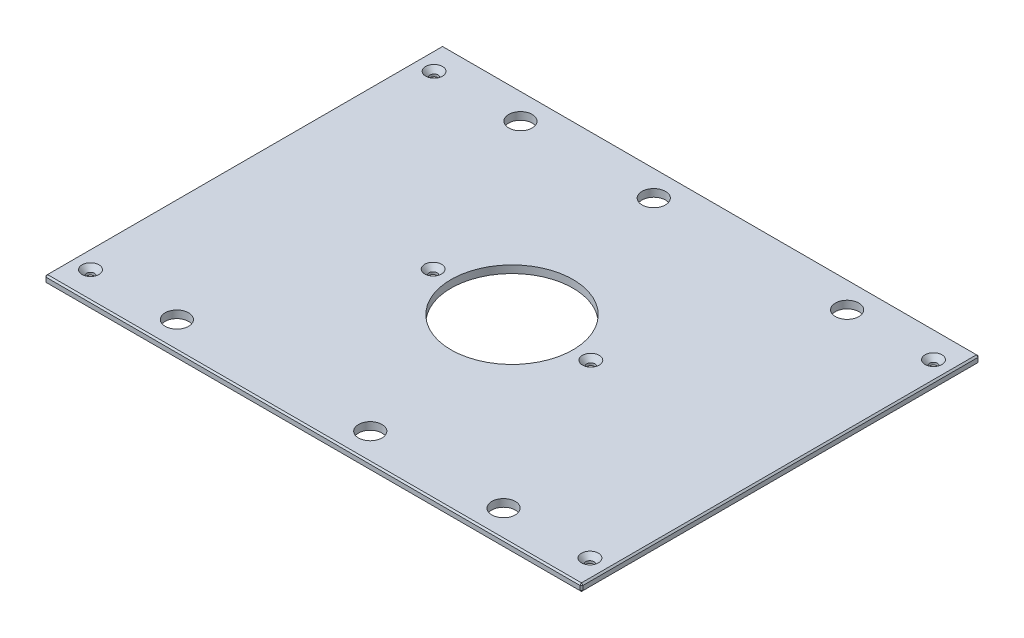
ISO-10303-21;
HEADER;
FILE_DESCRIPTION(('STEP AP214'),'2;1');
FILE_NAME('part.step','',(''),(''),'','','');
FILE_SCHEMA(('AUTOMOTIVE_DESIGN { 1 0 10303 214 1 1 1 1 }'));
ENDSEC;
DATA;
#1=APPLICATION_CONTEXT('core data for automotive mechanical design processes');
#2=APPLICATION_PROTOCOL_DEFINITION('international standard','automotive_design',2000,#1);
#3=PRODUCT_CONTEXT('',#1,'mechanical');
#4=PRODUCT('Part','Part','',(#3));
#5=PRODUCT_RELATED_PRODUCT_CATEGORY('part','',(#4));
#6=PRODUCT_DEFINITION_FORMATION('','',#4);
#7=PRODUCT_DEFINITION_CONTEXT('part definition',#1,'design');
#8=PRODUCT_DEFINITION('design','',#6,#7);
#9=PRODUCT_DEFINITION_SHAPE('','',#8);
#10=(LENGTH_UNIT() NAMED_UNIT(*) SI_UNIT(.MILLI.,.METRE.));
#11=(NAMED_UNIT(*) PLANE_ANGLE_UNIT() SI_UNIT($,.RADIAN.));
#12=(NAMED_UNIT(*) SI_UNIT($,.STERADIAN.) SOLID_ANGLE_UNIT());
#13=UNCERTAINTY_MEASURE_WITH_UNIT(LENGTH_MEASURE(1.E-05),#10,'distance_accuracy_value','');
#14=(GEOMETRIC_REPRESENTATION_CONTEXT(3) GLOBAL_UNCERTAINTY_ASSIGNED_CONTEXT((#13)) GLOBAL_UNIT_ASSIGNED_CONTEXT((#10,
#11,#12)) REPRESENTATION_CONTEXT('',''));
#15=CARTESIAN_POINT('',(0.,0.,0.));
#16=DIRECTION('',(0.,0.,1.));
#17=DIRECTION('',(1.,0.,0.));
#18=AXIS2_PLACEMENT_3D('',#15,#16,#17);
#19=CARTESIAN_POINT('',(-227.0125,6.35,-168.275));
#20=DIRECTION('',(1.,0.,0.));
#21=DIRECTION('',(0.,0.,-1.));
#22=AXIS2_PLACEMENT_3D('',#19,#20,#21);
#23=PLANE('',#22);
#24=DIRECTION('',(0.,0.,-1.));
#25=VECTOR('',#24,1.);
#26=CARTESIAN_POINT('',(-227.0125,5.08000000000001,-168.275));
#27=LINE('',#26,#25);
#28=CARTESIAN_POINT('',(-227.0125,5.08000000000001,167.005));
#29=VERTEX_POINT('',#28);
#30=CARTESIAN_POINT('',(-227.0125,5.08000000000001,-167.005));
#31=VERTEX_POINT('',#30);
#32=EDGE_CURVE('E140',#29,#31,#27,.T.);
#33=ORIENTED_EDGE('',*,*,#32,.T.);
#34=DIRECTION('',(0.,-1.,0.));
#35=VECTOR('',#34,1.);
#36=CARTESIAN_POINT('',(-227.0125,6.35,-167.005));
#37=LINE('',#36,#35);
#38=CARTESIAN_POINT('',(-227.0125,1.26999999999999,-167.005));
#39=VERTEX_POINT('',#38);
#40=EDGE_CURVE('E135',#31,#39,#37,.T.);
#41=ORIENTED_EDGE('',*,*,#40,.T.);
#42=DIRECTION('',(0.,0.,1.));
#43=VECTOR('',#42,1.);
#44=CARTESIAN_POINT('',(-227.0125,1.26999999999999,-168.275));
#45=LINE('',#44,#43);
#46=CARTESIAN_POINT('',(-227.0125,1.26999999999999,167.005));
#47=VERTEX_POINT('',#46);
#48=EDGE_CURVE('E130',#39,#47,#45,.T.);
#49=ORIENTED_EDGE('',*,*,#48,.T.);
#50=DIRECTION('',(0.,1.,0.));
#51=VECTOR('',#50,1.);
#52=CARTESIAN_POINT('',(-227.0125,6.35,167.005));
#53=LINE('',#52,#51);
#54=EDGE_CURVE('E132',#47,#29,#53,.T.);
#55=ORIENTED_EDGE('',*,*,#54,.T.);
#56=EDGE_LOOP('',(#33,#41,#49,#55));
#57=FACE_BOUND('',#56,.T.);
#58=ADVANCED_FACE('F38',(#57),#23,.F.);
#59=CARTESIAN_POINT('',(-227.0125,6.35,168.275));
#60=DIRECTION('',(0.,0.,-1.));
#61=DIRECTION('',(-1.,0.,0.));
#62=AXIS2_PLACEMENT_3D('',#59,#60,#61);
#63=PLANE('',#62);
#64=DIRECTION('',(1.,0.,0.));
#65=VECTOR('',#64,1.);
#66=CARTESIAN_POINT('',(-227.0125,1.26999999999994,168.275));
#67=LINE('',#66,#65);
#68=CARTESIAN_POINT('',(-225.7425,1.26999999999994,168.275));
#69=VERTEX_POINT('',#68);
#70=CARTESIAN_POINT('',(225.7425,1.26999999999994,168.275));
#71=VERTEX_POINT('',#70);
#72=EDGE_CURVE('E62',#69,#71,#67,.T.);
#73=ORIENTED_EDGE('',*,*,#72,.T.);
#74=DIRECTION('',(0.,1.,0.));
#75=VECTOR('',#74,1.);
#76=CARTESIAN_POINT('',(225.7425,6.35,168.275));
#77=LINE('',#76,#75);
#78=CARTESIAN_POINT('',(225.7425,5.08000000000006,168.275));
#79=VERTEX_POINT('',#78);
#80=EDGE_CURVE('E11',#71,#79,#77,.T.);
#81=ORIENTED_EDGE('',*,*,#80,.T.);
#82=DIRECTION('',(-1.,0.,0.));
#83=VECTOR('',#82,1.);
#84=CARTESIAN_POINT('',(-227.0125,5.08000000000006,168.275));
#85=LINE('',#84,#83);
#86=CARTESIAN_POINT('',(-225.7425,5.08000000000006,168.275));
#87=VERTEX_POINT('',#86);
#88=EDGE_CURVE('E48',#79,#87,#85,.T.);
#89=ORIENTED_EDGE('',*,*,#88,.T.);
#90=DIRECTION('',(0.,-1.,0.));
#91=VECTOR('',#90,1.);
#92=CARTESIAN_POINT('',(-225.7425,6.35,168.275));
#93=LINE('',#92,#91);
#94=EDGE_CURVE('E348',#87,#69,#93,.T.);
#95=ORIENTED_EDGE('',*,*,#94,.T.);
#96=EDGE_LOOP('',(#73,#81,#89,#95));
#97=FACE_BOUND('',#96,.T.);
#98=ADVANCED_FACE('F427',(#97),#63,.F.);
#99=CARTESIAN_POINT('',(227.0125,6.35,-168.275));
#100=DIRECTION('',(-1.,0.,0.));
#101=DIRECTION('',(0.,0.,1.));
#102=AXIS2_PLACEMENT_3D('',#99,#100,#101);
#103=PLANE('',#102);
#104=DIRECTION('',(0.,0.,-1.));
#105=VECTOR('',#104,1.);
#106=CARTESIAN_POINT('',(227.0125,1.26999999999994,-168.275));
#107=LINE('',#106,#105);
#108=CARTESIAN_POINT('',(227.0125,1.26999999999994,167.005));
#109=VERTEX_POINT('',#108);
#110=CARTESIAN_POINT('',(227.0125,1.26999999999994,-167.005));
#111=VERTEX_POINT('',#110);
#112=EDGE_CURVE('E341',#109,#111,#107,.T.);
#113=ORIENTED_EDGE('',*,*,#112,.T.);
#114=DIRECTION('',(0.,1.,0.));
#115=VECTOR('',#114,1.);
#116=CARTESIAN_POINT('',(227.0125,6.35,-167.005));
#117=LINE('',#116,#115);
#118=CARTESIAN_POINT('',(227.0125,5.08000000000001,-167.005));
#119=VERTEX_POINT('',#118);
#120=EDGE_CURVE('E344',#111,#119,#117,.T.);
#121=ORIENTED_EDGE('',*,*,#120,.T.);
#122=DIRECTION('',(0.,0.,1.));
#123=VECTOR('',#122,1.);
#124=CARTESIAN_POINT('',(227.0125,5.08000000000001,168.275));
#125=LINE('',#124,#123);
#126=CARTESIAN_POINT('',(227.0125,5.08000000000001,167.005));
#127=VERTEX_POINT('',#126);
#128=EDGE_CURVE('E338',#119,#127,#125,.T.);
#129=ORIENTED_EDGE('',*,*,#128,.T.);
#130=DIRECTION('',(0.,-1.,0.));
#131=VECTOR('',#130,1.);
#132=CARTESIAN_POINT('',(227.0125,6.35,167.005));
#133=LINE('',#132,#131);
#134=EDGE_CURVE('E335',#127,#109,#133,.T.);
#135=ORIENTED_EDGE('',*,*,#134,.T.);
#136=EDGE_LOOP('',(#113,#121,#129,#135));
#137=FACE_BOUND('',#136,.T.);
#138=ADVANCED_FACE('F414',(#137),#103,.F.);
#139=CARTESIAN_POINT('',(-227.0125,6.35,-168.275));
#140=DIRECTION('',(0.,0.,1.));
#141=DIRECTION('',(1.,0.,0.));
#142=AXIS2_PLACEMENT_3D('',#139,#140,#141);
#143=PLANE('',#142);
#144=DIRECTION('',(-1.,0.,0.));
#145=VECTOR('',#144,1.);
#146=CARTESIAN_POINT('',(-227.0125,1.26999999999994,-168.275));
#147=LINE('',#146,#145);
#148=CARTESIAN_POINT('',(225.7425,1.26999999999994,-168.275));
#149=VERTEX_POINT('',#148);
#150=CARTESIAN_POINT('',(-225.7425,1.26999999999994,-168.275));
#151=VERTEX_POINT('',#150);
#152=EDGE_CURVE('E300',#149,#151,#147,.T.);
#153=ORIENTED_EDGE('',*,*,#152,.T.);
#154=DIRECTION('',(0.,1.,0.));
#155=VECTOR('',#154,1.);
#156=CARTESIAN_POINT('',(-225.7425,6.35,-168.275));
#157=LINE('',#156,#155);
#158=CARTESIAN_POINT('',(-225.7425,5.08000000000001,-168.275));
#159=VERTEX_POINT('',#158);
#160=EDGE_CURVE('E306',#151,#159,#157,.T.);
#161=ORIENTED_EDGE('',*,*,#160,.T.);
#162=DIRECTION('',(1.,0.,0.));
#163=VECTOR('',#162,1.);
#164=CARTESIAN_POINT('',(227.0125,5.08000000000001,-168.275));
#165=LINE('',#164,#163);
#166=CARTESIAN_POINT('',(225.7425,5.08000000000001,-168.275));
#167=VERTEX_POINT('',#166);
#168=EDGE_CURVE('E303',#159,#167,#165,.T.);
#169=ORIENTED_EDGE('',*,*,#168,.T.);
#170=DIRECTION('',(0.,-1.,0.));
#171=VECTOR('',#170,1.);
#172=CARTESIAN_POINT('',(225.7425,6.35,-168.275));
#173=LINE('',#172,#171);
#174=EDGE_CURVE('E297',#167,#149,#173,.T.);
#175=ORIENTED_EDGE('',*,*,#174,.T.);
#176=EDGE_LOOP('',(#153,#161,#169,#175));
#177=FACE_BOUND('',#176,.T.);
#178=ADVANCED_FACE('F388',(#177),#143,.F.);
#179=CARTESIAN_POINT('',(0.,6.35,0.));
#180=DIRECTION('',(0.,1.,0.));
#181=DIRECTION('',(0.,0.,1.));
#182=AXIS2_PLACEMENT_3D('',#179,#180,#181);
#183=PLANE('',#182);
#184=CARTESIAN_POINT('',(211.1375,6.35,-145.25498));
#185=DIRECTION('',(0.,1.,0.));
#186=DIRECTION('',(0.,0.,1.));
#187=AXIS2_PLACEMENT_3D('',#184,#185,#186);
#188=CIRCLE('',#187,7.13739999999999);
#189=CARTESIAN_POINT('',(211.1375,6.35,-138.11758));
#190=VERTEX_POINT('',#189);
#191=EDGE_CURVE('E927',#190,#190,#188,.T.);
#192=ORIENTED_EDGE('',*,*,#191,.F.);
#193=EDGE_LOOP('',(#192));
#194=FACE_BOUND('',#193,.T.);
#195=CARTESIAN_POINT('',(211.1375,6.35,145.25498));
#196=DIRECTION('',(0.,1.,0.));
#197=DIRECTION('',(0.,0.,1.));
#198=AXIS2_PLACEMENT_3D('',#195,#196,#197);
#199=CIRCLE('',#198,7.13739999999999);
#200=CARTESIAN_POINT('',(211.1375,6.35,152.39238));
#201=VERTEX_POINT('',#200);
#202=EDGE_CURVE('E931',#201,#201,#199,.T.);
#203=ORIENTED_EDGE('',*,*,#202,.F.);
#204=EDGE_LOOP('',(#203));
#205=FACE_BOUND('',#204,.T.);
#206=CARTESIAN_POINT('',(-211.1375,6.35,145.25498));
#207=DIRECTION('',(0.,1.,0.));
#208=DIRECTION('',(0.,0.,1.));
#209=AXIS2_PLACEMENT_3D('',#206,#207,#208);
#210=CIRCLE('',#209,7.13739999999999);
#211=CARTESIAN_POINT('',(-211.1375,6.35,152.39238));
#212=VERTEX_POINT('',#211);
#213=EDGE_CURVE('E935',#212,#212,#210,.T.);
#214=ORIENTED_EDGE('',*,*,#213,.F.);
#215=EDGE_LOOP('',(#214));
#216=FACE_BOUND('',#215,.T.);
#217=CARTESIAN_POINT('',(-66.675,6.35,0.));
#218=DIRECTION('',(0.,1.,0.));
#219=DIRECTION('',(0.,0.,1.));
#220=AXIS2_PLACEMENT_3D('',#217,#218,#219);
#221=CIRCLE('',#220,7.1374);
#222=CARTESIAN_POINT('',(-66.675,6.35,7.1374));
#223=VERTEX_POINT('',#222);
#224=EDGE_CURVE('E939',#223,#223,#221,.T.);
#225=ORIENTED_EDGE('',*,*,#224,.F.);
#226=EDGE_LOOP('',(#225));
#227=FACE_BOUND('',#226,.T.);
#228=CARTESIAN_POINT('',(66.675,6.35,0.));
#229=DIRECTION('',(0.,1.,0.));
#230=DIRECTION('',(0.,0.,1.));
#231=AXIS2_PLACEMENT_3D('',#228,#229,#230);
#232=CIRCLE('',#231,7.1374);
#233=CARTESIAN_POINT('',(66.675,6.35,7.1374));
#234=VERTEX_POINT('',#233);
#235=EDGE_CURVE('E943',#234,#234,#232,.T.);
#236=ORIENTED_EDGE('',*,*,#235,.F.);
#237=EDGE_LOOP('',(#236));
#238=FACE_BOUND('',#237,.T.);
#239=CARTESIAN_POINT('',(-211.1375,6.35,-145.25498));
#240=DIRECTION('',(0.,1.,0.));
#241=DIRECTION('',(0.,0.,1.));
#242=AXIS2_PLACEMENT_3D('',#239,#240,#241);
#243=CIRCLE('',#242,7.13739999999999);
#244=CARTESIAN_POINT('',(-211.1375,6.35,-138.11758));
#245=VERTEX_POINT('',#244);
#246=EDGE_CURVE('E946',#245,#245,#243,.T.);
#247=ORIENTED_EDGE('',*,*,#246,.F.);
#248=EDGE_LOOP('',(#247));
#249=FACE_BOUND('',#248,.T.);
#250=DIRECTION('',(0.,0.,-1.));
#251=VECTOR('',#250,1.);
#252=CARTESIAN_POINT('',(225.7425,6.35,-168.275));
#253=LINE('',#252,#251);
#254=CARTESIAN_POINT('',(225.7425,6.35,167.005));
#255=VERTEX_POINT('',#254);
#256=CARTESIAN_POINT('',(225.7425,6.35,-167.005));
#257=VERTEX_POINT('',#256);
#258=EDGE_CURVE('E316',#255,#257,#253,.T.);
#259=ORIENTED_EDGE('',*,*,#258,.T.);
#260=DIRECTION('',(-1.,0.,0.));
#261=VECTOR('',#260,1.);
#262=CARTESIAN_POINT('',(-227.0125,6.35,-167.005));
#263=LINE('',#262,#261);
#264=CARTESIAN_POINT('',(-225.7425,6.35,-167.005));
#265=VERTEX_POINT('',#264);
#266=EDGE_CURVE('E319',#257,#265,#263,.T.);
#267=ORIENTED_EDGE('',*,*,#266,.T.);
#268=DIRECTION('',(0.,0.,1.));
#269=VECTOR('',#268,1.);
#270=CARTESIAN_POINT('',(-225.7425,6.35,168.275));
#271=LINE('',#270,#269);
#272=CARTESIAN_POINT('',(-225.7425,6.35,167.005));
#273=VERTEX_POINT('',#272);
#274=EDGE_CURVE('E313',#265,#273,#271,.T.);
#275=ORIENTED_EDGE('',*,*,#274,.T.);
#276=DIRECTION('',(1.,0.,0.));
#277=VECTOR('',#276,1.);
#278=CARTESIAN_POINT('',(227.0125,6.35,167.005));
#279=LINE('',#278,#277);
#280=EDGE_CURVE('E310',#273,#255,#279,.T.);
#281=ORIENTED_EDGE('',*,*,#280,.T.);
#282=EDGE_LOOP('',(#259,#267,#275,#281));
#283=FACE_BOUND('',#282,.T.);
#284=CARTESIAN_POINT('',(138.1125,6.35,-145.25498));
#285=DIRECTION('',(0.,1.,0.));
#286=DIRECTION('',(0.,0.,1.));
#287=AXIS2_PLACEMENT_3D('',#284,#285,#286);
#288=CIRCLE('',#287,9.921875);
#289=CARTESIAN_POINT('',(138.1125,6.35,-135.333105));
#290=VERTEX_POINT('',#289);
#291=EDGE_CURVE('E229',#290,#290,#288,.T.);
#292=ORIENTED_EDGE('',*,*,#291,.F.);
#293=EDGE_LOOP('',(#292));
#294=FACE_BOUND('',#293,.T.);
#295=CARTESIAN_POINT('',(-138.1125,6.35,-145.25498));
#296=DIRECTION('',(0.,1.,0.));
#297=DIRECTION('',(0.,0.,1.));
#298=AXIS2_PLACEMENT_3D('',#295,#296,#297);
#299=CIRCLE('',#298,9.921875);
#300=CARTESIAN_POINT('',(-138.1125,6.35,-135.333105));
#301=VERTEX_POINT('',#300);
#302=EDGE_CURVE('E243',#301,#301,#299,.T.);
#303=ORIENTED_EDGE('',*,*,#302,.F.);
#304=EDGE_LOOP('',(#303));
#305=FACE_BOUND('',#304,.T.);
#306=CARTESIAN_POINT('',(138.1125,6.35,145.25498));
#307=DIRECTION('',(0.,1.,0.));
#308=DIRECTION('',(0.,0.,1.));
#309=AXIS2_PLACEMENT_3D('',#306,#307,#308);
#310=CIRCLE('',#309,9.921875);
#311=CARTESIAN_POINT('',(138.1125,6.35,155.176855));
#312=VERTEX_POINT('',#311);
#313=EDGE_CURVE('E255',#312,#312,#310,.T.);
#314=ORIENTED_EDGE('',*,*,#313,.F.);
#315=EDGE_LOOP('',(#314));
#316=FACE_BOUND('',#315,.T.);
#317=CARTESIAN_POINT('',(-138.1125,6.35,145.25498));
#318=DIRECTION('',(0.,1.,0.));
#319=DIRECTION('',(0.,0.,1.));
#320=AXIS2_PLACEMENT_3D('',#317,#318,#319);
#321=CIRCLE('',#320,9.921875);
#322=CARTESIAN_POINT('',(-138.1125,6.35,155.176855));
#323=VERTEX_POINT('',#322);
#324=EDGE_CURVE('E262',#323,#323,#321,.T.);
#325=ORIENTED_EDGE('',*,*,#324,.F.);
#326=EDGE_LOOP('',(#325));
#327=FACE_BOUND('',#326,.T.);
#328=CARTESIAN_POINT('',(-25.4,6.35,-145.25498));
#329=DIRECTION('',(0.,1.,0.));
#330=DIRECTION('',(0.,0.,1.));
#331=AXIS2_PLACEMENT_3D('',#328,#329,#330);
#332=CIRCLE('',#331,9.921875);
#333=CARTESIAN_POINT('',(-25.4,6.35,-135.333105));
#334=VERTEX_POINT('',#333);
#335=EDGE_CURVE('E270',#334,#334,#332,.T.);
#336=ORIENTED_EDGE('',*,*,#335,.F.);
#337=EDGE_LOOP('',(#336));
#338=FACE_BOUND('',#337,.T.);
#339=CARTESIAN_POINT('',(25.4,6.35,145.25498));
#340=DIRECTION('',(0.,1.,0.));
#341=DIRECTION('',(0.,0.,1.));
#342=AXIS2_PLACEMENT_3D('',#339,#340,#341);
#343=CIRCLE('',#342,9.921875);
#344=CARTESIAN_POINT('',(25.4,6.35,155.176855));
#345=VERTEX_POINT('',#344);
#346=EDGE_CURVE('E278',#345,#345,#343,.T.);
#347=ORIENTED_EDGE('',*,*,#346,.F.);
#348=EDGE_LOOP('',(#347));
#349=FACE_BOUND('',#348,.T.);
#350=CARTESIAN_POINT('',(0.,6.35,0.));
#351=DIRECTION('',(0.,1.,0.));
#352=DIRECTION('',(0.,0.,1.));
#353=AXIS2_PLACEMENT_3D('',#350,#351,#352);
#354=CIRCLE('',#353,51.562);
#355=CARTESIAN_POINT('',(0.,6.35,51.562));
#356=VERTEX_POINT('',#355);
#357=EDGE_CURVE('E286',#356,#356,#354,.T.);
#358=ORIENTED_EDGE('',*,*,#357,.F.);
#359=EDGE_LOOP('',(#358));
#360=FACE_BOUND('',#359,.T.);
#361=ADVANCED_FACE('F436',(#194,#205,#216,#227,#238,#249,#283,#294,#305,#316,#327,#338,#349,
#360),#183,.T.);
#362=CARTESIAN_POINT('',(0.,0.,0.));
#363=DIRECTION('',(0.,1.,0.));
#364=DIRECTION('',(0.,0.,1.));
#365=AXIS2_PLACEMENT_3D('',#362,#363,#364);
#366=PLANE('',#365);
#367=CARTESIAN_POINT('',(211.1375,0.,-145.25498));
#368=DIRECTION('',(0.,1.,0.));
#369=DIRECTION('',(0.,0.,1.));
#370=AXIS2_PLACEMENT_3D('',#367,#368,#369);
#371=CIRCLE('',#370,3.3782);
#372=CARTESIAN_POINT('',(211.1375,0.,-141.87678));
#373=VERTEX_POINT('',#372);
#374=EDGE_CURVE('E992',#373,#373,#371,.T.);
#375=ORIENTED_EDGE('',*,*,#374,.T.);
#376=EDGE_LOOP('',(#375));
#377=FACE_BOUND('',#376,.T.);
#378=CARTESIAN_POINT('',(211.1375,0.,145.25498));
#379=DIRECTION('',(0.,1.,0.));
#380=DIRECTION('',(0.,0.,1.));
#381=AXIS2_PLACEMENT_3D('',#378,#379,#380);
#382=CIRCLE('',#381,3.3782);
#383=CARTESIAN_POINT('',(211.1375,0.,148.63318));
#384=VERTEX_POINT('',#383);
#385=EDGE_CURVE('E982',#384,#384,#382,.T.);
#386=ORIENTED_EDGE('',*,*,#385,.T.);
#387=EDGE_LOOP('',(#386));
#388=FACE_BOUND('',#387,.T.);
#389=CARTESIAN_POINT('',(-211.1375,0.,145.25498));
#390=DIRECTION('',(0.,1.,0.));
#391=DIRECTION('',(0.,0.,1.));
#392=AXIS2_PLACEMENT_3D('',#389,#390,#391);
#393=CIRCLE('',#392,3.3782);
#394=CARTESIAN_POINT('',(-211.1375,0.,148.63318));
#395=VERTEX_POINT('',#394);
#396=EDGE_CURVE('E972',#395,#395,#393,.T.);
#397=ORIENTED_EDGE('',*,*,#396,.T.);
#398=EDGE_LOOP('',(#397));
#399=FACE_BOUND('',#398,.T.);
#400=CARTESIAN_POINT('',(-66.675,0.,0.));
#401=DIRECTION('',(0.,1.,0.));
#402=DIRECTION('',(0.,0.,1.));
#403=AXIS2_PLACEMENT_3D('',#400,#401,#402);
#404=CIRCLE('',#403,3.3782);
#405=CARTESIAN_POINT('',(-66.675,0.,3.3782));
#406=VERTEX_POINT('',#405);
#407=EDGE_CURVE('E964',#406,#406,#404,.T.);
#408=ORIENTED_EDGE('',*,*,#407,.T.);
#409=EDGE_LOOP('',(#408));
#410=FACE_BOUND('',#409,.T.);
#411=CARTESIAN_POINT('',(66.675,0.,0.));
#412=DIRECTION('',(0.,1.,0.));
#413=DIRECTION('',(0.,0.,1.));
#414=AXIS2_PLACEMENT_3D('',#411,#412,#413);
#415=CIRCLE('',#414,3.3782);
#416=CARTESIAN_POINT('',(66.675,0.,3.3782));
#417=VERTEX_POINT('',#416);
#418=EDGE_CURVE('E950',#417,#417,#415,.T.);
#419=ORIENTED_EDGE('',*,*,#418,.T.);
#420=EDGE_LOOP('',(#419));
#421=FACE_BOUND('',#420,.T.);
#422=CARTESIAN_POINT('',(-211.1375,0.,-145.25498));
#423=DIRECTION('',(0.,1.,0.));
#424=DIRECTION('',(0.,0.,1.));
#425=AXIS2_PLACEMENT_3D('',#422,#423,#424);
#426=CIRCLE('',#425,3.3782);
#427=CARTESIAN_POINT('',(-211.1375,0.,-141.87678));
#428=VERTEX_POINT('',#427);
#429=EDGE_CURVE('E246',#428,#428,#426,.T.);
#430=ORIENTED_EDGE('',*,*,#429,.T.);
#431=EDGE_LOOP('',(#430));
#432=FACE_BOUND('',#431,.T.);
#433=DIRECTION('',(0.,0.,-1.));
#434=VECTOR('',#433,1.);
#435=CARTESIAN_POINT('',(-225.7425,0.,0.));
#436=LINE('',#435,#434);
#437=CARTESIAN_POINT('',(-225.7425,0.,167.005));
#438=VERTEX_POINT('',#437);
#439=CARTESIAN_POINT('',(-225.7425,0.,-167.005));
#440=VERTEX_POINT('',#439);
#441=EDGE_CURVE('E165',#438,#440,#436,.T.);
#442=ORIENTED_EDGE('',*,*,#441,.T.);
#443=DIRECTION('',(1.,0.,0.));
#444=VECTOR('',#443,1.);
#445=CARTESIAN_POINT('',(0.,0.,-167.005));
#446=LINE('',#445,#444);
#447=CARTESIAN_POINT('',(225.7425,0.,-167.005));
#448=VERTEX_POINT('',#447);
#449=EDGE_CURVE('E331',#440,#448,#446,.T.);
#450=ORIENTED_EDGE('',*,*,#449,.T.);
#451=DIRECTION('',(0.,0.,1.));
#452=VECTOR('',#451,1.);
#453=CARTESIAN_POINT('',(225.7425,0.,0.));
#454=LINE('',#453,#452);
#455=CARTESIAN_POINT('',(225.7425,0.,167.005));
#456=VERTEX_POINT('',#455);
#457=EDGE_CURVE('E328',#448,#456,#454,.T.);
#458=ORIENTED_EDGE('',*,*,#457,.T.);
#459=DIRECTION('',(-1.,0.,0.));
#460=VECTOR('',#459,1.);
#461=CARTESIAN_POINT('',(0.,0.,167.005));
#462=LINE('',#461,#460);
#463=EDGE_CURVE('E323',#456,#438,#462,.T.);
#464=ORIENTED_EDGE('',*,*,#463,.T.);
#465=EDGE_LOOP('',(#442,#450,#458,#464));
#466=FACE_BOUND('',#465,.T.);
#467=CARTESIAN_POINT('',(138.1125,0.,-145.25498));
#468=DIRECTION('',(0.,1.,0.));
#469=DIRECTION('',(0.,0.,1.));
#470=AXIS2_PLACEMENT_3D('',#467,#468,#469);
#471=CIRCLE('',#470,9.921875);
#472=CARTESIAN_POINT('',(138.1125,0.,-135.333105));
#473=VERTEX_POINT('',#472);
#474=EDGE_CURVE('E236',#473,#473,#471,.T.);
#475=ORIENTED_EDGE('',*,*,#474,.T.);
#476=EDGE_LOOP('',(#475));
#477=FACE_BOUND('',#476,.T.);
#478=CARTESIAN_POINT('',(-138.1125,0.,-145.25498));
#479=DIRECTION('',(0.,1.,0.));
#480=DIRECTION('',(0.,0.,1.));
#481=AXIS2_PLACEMENT_3D('',#478,#479,#480);
#482=CIRCLE('',#481,9.921875);
#483=CARTESIAN_POINT('',(-138.1125,0.,-135.333105));
#484=VERTEX_POINT('',#483);
#485=EDGE_CURVE('E251',#484,#484,#482,.T.);
#486=ORIENTED_EDGE('',*,*,#485,.T.);
#487=EDGE_LOOP('',(#486));
#488=FACE_BOUND('',#487,.T.);
#489=CARTESIAN_POINT('',(138.1125,0.,145.25498));
#490=DIRECTION('',(0.,1.,0.));
#491=DIRECTION('',(0.,0.,1.));
#492=AXIS2_PLACEMENT_3D('',#489,#490,#491);
#493=CIRCLE('',#492,9.921875);
#494=CARTESIAN_POINT('',(138.1125,0.,155.176855));
#495=VERTEX_POINT('',#494);
#496=EDGE_CURVE('E258',#495,#495,#493,.T.);
#497=ORIENTED_EDGE('',*,*,#496,.T.);
#498=EDGE_LOOP('',(#497));
#499=FACE_BOUND('',#498,.T.);
#500=CARTESIAN_POINT('',(-138.1125,0.,145.25498));
#501=DIRECTION('',(0.,1.,0.));
#502=DIRECTION('',(0.,0.,1.));
#503=AXIS2_PLACEMENT_3D('',#500,#501,#502);
#504=CIRCLE('',#503,9.921875);
#505=CARTESIAN_POINT('',(-138.1125,0.,155.176855));
#506=VERTEX_POINT('',#505);
#507=EDGE_CURVE('E266',#506,#506,#504,.T.);
#508=ORIENTED_EDGE('',*,*,#507,.T.);
#509=EDGE_LOOP('',(#508));
#510=FACE_BOUND('',#509,.T.);
#511=CARTESIAN_POINT('',(-25.4,0.,-145.25498));
#512=DIRECTION('',(0.,1.,0.));
#513=DIRECTION('',(0.,0.,1.));
#514=AXIS2_PLACEMENT_3D('',#511,#512,#513);
#515=CIRCLE('',#514,9.921875);
#516=CARTESIAN_POINT('',(-25.4,0.,-135.333105));
#517=VERTEX_POINT('',#516);
#518=EDGE_CURVE('E274',#517,#517,#515,.T.);
#519=ORIENTED_EDGE('',*,*,#518,.T.);
#520=EDGE_LOOP('',(#519));
#521=FACE_BOUND('',#520,.T.);
#522=CARTESIAN_POINT('',(25.4,0.,145.25498));
#523=DIRECTION('',(0.,1.,0.));
#524=DIRECTION('',(0.,0.,1.));
#525=AXIS2_PLACEMENT_3D('',#522,#523,#524);
#526=CIRCLE('',#525,9.921875);
#527=CARTESIAN_POINT('',(25.4,0.,155.176855));
#528=VERTEX_POINT('',#527);
#529=EDGE_CURVE('E282',#528,#528,#526,.T.);
#530=ORIENTED_EDGE('',*,*,#529,.T.);
#531=EDGE_LOOP('',(#530));
#532=FACE_BOUND('',#531,.T.);
#533=CARTESIAN_POINT('',(0.,0.,0.));
#534=DIRECTION('',(0.,1.,0.));
#535=DIRECTION('',(0.,0.,1.));
#536=AXIS2_PLACEMENT_3D('',#533,#534,#535);
#537=CIRCLE('',#536,51.562);
#538=CARTESIAN_POINT('',(0.,0.,51.562));
#539=VERTEX_POINT('',#538);
#540=EDGE_CURVE('E153',#539,#539,#537,.T.);
#541=ORIENTED_EDGE('',*,*,#540,.T.);
#542=EDGE_LOOP('',(#541));
#543=FACE_BOUND('',#542,.T.);
#544=ADVANCED_FACE('F401',(#377,#388,#399,#410,#421,#432,#466,#477,#488,#499,#510,#521,#532,
#543),#366,.F.);
#545=CARTESIAN_POINT('',(0.,0.,0.));
#546=DIRECTION('',(0.,1.,0.));
#547=DIRECTION('',(0.,0.,1.));
#548=AXIS2_PLACEMENT_3D('',#545,#546,#547);
#549=CYLINDRICAL_SURFACE('',#548,51.562);
#550=ORIENTED_EDGE('',*,*,#540,.F.);
#551=EDGE_LOOP('',(#550));
#552=FACE_BOUND('',#551,.T.);
#553=ORIENTED_EDGE('',*,*,#357,.T.);
#554=EDGE_LOOP('',(#553));
#555=FACE_BOUND('',#554,.T.);
#556=ADVANCED_FACE('F682',(#552,#555),#549,.F.);
#557=CARTESIAN_POINT('',(25.4,6.35,145.25498));
#558=DIRECTION('',(0.,1.,0.));
#559=DIRECTION('',(0.,0.,1.));
#560=AXIS2_PLACEMENT_3D('',#557,#558,#559);
#561=CYLINDRICAL_SURFACE('',#560,9.921875);
#562=ORIENTED_EDGE('',*,*,#529,.F.);
#563=EDGE_LOOP('',(#562));
#564=FACE_BOUND('',#563,.T.);
#565=ORIENTED_EDGE('',*,*,#346,.T.);
#566=EDGE_LOOP('',(#565));
#567=FACE_BOUND('',#566,.T.);
#568=ADVANCED_FACE('F856',(#564,#567),#561,.F.);
#569=CARTESIAN_POINT('',(-25.4,6.35,-145.25498));
#570=DIRECTION('',(0.,1.,0.));
#571=DIRECTION('',(0.,0.,1.));
#572=AXIS2_PLACEMENT_3D('',#569,#570,#571);
#573=CYLINDRICAL_SURFACE('',#572,9.921875);
#574=ORIENTED_EDGE('',*,*,#518,.F.);
#575=EDGE_LOOP('',(#574));
#576=FACE_BOUND('',#575,.T.);
#577=ORIENTED_EDGE('',*,*,#335,.T.);
#578=EDGE_LOOP('',(#577));
#579=FACE_BOUND('',#578,.T.);
#580=ADVANCED_FACE('F846',(#576,#579),#573,.F.);
#581=CARTESIAN_POINT('',(-138.1125,6.35,145.25498));
#582=DIRECTION('',(0.,1.,0.));
#583=DIRECTION('',(0.,0.,1.));
#584=AXIS2_PLACEMENT_3D('',#581,#582,#583);
#585=CYLINDRICAL_SURFACE('',#584,9.921875);
#586=ORIENTED_EDGE('',*,*,#507,.F.);
#587=EDGE_LOOP('',(#586));
#588=FACE_BOUND('',#587,.T.);
#589=ORIENTED_EDGE('',*,*,#324,.T.);
#590=EDGE_LOOP('',(#589));
#591=FACE_BOUND('',#590,.T.);
#592=ADVANCED_FACE('F836',(#588,#591),#585,.F.);
#593=CARTESIAN_POINT('',(138.1125,6.35,145.25498));
#594=DIRECTION('',(0.,1.,0.));
#595=DIRECTION('',(0.,0.,1.));
#596=AXIS2_PLACEMENT_3D('',#593,#594,#595);
#597=CYLINDRICAL_SURFACE('',#596,9.921875);
#598=ORIENTED_EDGE('',*,*,#496,.F.);
#599=EDGE_LOOP('',(#598));
#600=FACE_BOUND('',#599,.T.);
#601=ORIENTED_EDGE('',*,*,#313,.T.);
#602=EDGE_LOOP('',(#601));
#603=FACE_BOUND('',#602,.T.);
#604=ADVANCED_FACE('F826',(#600,#603),#597,.F.);
#605=CARTESIAN_POINT('',(-138.1125,6.35,-145.25498));
#606=DIRECTION('',(0.,1.,0.));
#607=DIRECTION('',(0.,0.,1.));
#608=AXIS2_PLACEMENT_3D('',#605,#606,#607);
#609=CYLINDRICAL_SURFACE('',#608,9.921875);
#610=ORIENTED_EDGE('',*,*,#485,.F.);
#611=EDGE_LOOP('',(#610));
#612=FACE_BOUND('',#611,.T.);
#613=ORIENTED_EDGE('',*,*,#302,.T.);
#614=EDGE_LOOP('',(#613));
#615=FACE_BOUND('',#614,.T.);
#616=ADVANCED_FACE('F816',(#612,#615),#609,.F.);
#617=CARTESIAN_POINT('',(138.1125,6.35,-145.25498));
#618=DIRECTION('',(0.,1.,0.));
#619=DIRECTION('',(0.,0.,1.));
#620=AXIS2_PLACEMENT_3D('',#617,#618,#619);
#621=CYLINDRICAL_SURFACE('',#620,9.921875);
#622=ORIENTED_EDGE('',*,*,#474,.F.);
#623=EDGE_LOOP('',(#622));
#624=FACE_BOUND('',#623,.T.);
#625=ORIENTED_EDGE('',*,*,#291,.T.);
#626=EDGE_LOOP('',(#625));
#627=FACE_BOUND('',#626,.T.);
#628=ADVANCED_FACE('F445',(#624,#627),#621,.F.);
#629=CARTESIAN_POINT('',(227.0125,6.35,167.005));
#630=DIRECTION('',(-0.707106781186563,0.,-0.707106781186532));
#631=DIRECTION('',(0.,-1.,0.));
#632=AXIS2_PLACEMENT_3D('',#629,#630,#631);
#633=PLANE('',#632);
#634=DIRECTION('',(-0.707106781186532,0.,0.707106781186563));
#635=VECTOR('',#634,1.);
#636=CARTESIAN_POINT('',(227.0125,5.08000000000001,167.005));
#637=LINE('',#636,#635);
#638=EDGE_CURVE('E42',#79,#127,#637,.F.);
#639=ORIENTED_EDGE('',*,*,#638,.F.);
#640=ORIENTED_EDGE('',*,*,#80,.F.);
#641=DIRECTION('',(0.707106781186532,0.,-0.707106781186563));
#642=VECTOR('',#641,1.);
#643=CARTESIAN_POINT('',(226.3775,1.26999999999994,167.64));
#644=LINE('',#643,#642);
#645=EDGE_CURVE('E219',#109,#71,#644,.F.);
#646=ORIENTED_EDGE('',*,*,#645,.F.);
#647=ORIENTED_EDGE('',*,*,#134,.F.);
#648=EDGE_LOOP('',(#639,#640,#646,#647));
#649=FACE_BOUND('',#648,.T.);
#650=ADVANCED_FACE('F40',(#649),#633,.F.);
#651=CARTESIAN_POINT('',(227.0125,5.08000000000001,167.005));
#652=DIRECTION('',(0.577350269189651,0.577350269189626,0.577350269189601));
#653=DIRECTION('',(-0.707106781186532,0.707106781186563,0.));
#654=AXIS2_PLACEMENT_3D('',#651,#652,#653);
#655=PLANE('',#654);
#656=DIRECTION('',(0.,-0.707106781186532,0.707106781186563));
#657=VECTOR('',#656,1.);
#658=CARTESIAN_POINT('',(225.7425,5.71500000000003,167.64));
#659=LINE('',#658,#657);
#660=EDGE_CURVE('E214',#79,#255,#659,.F.);
#661=ORIENTED_EDGE('',*,*,#660,.F.);
#662=ORIENTED_EDGE('',*,*,#638,.T.);
#663=DIRECTION('',(-0.707106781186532,0.707106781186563,0.));
#664=VECTOR('',#663,1.);
#665=CARTESIAN_POINT('',(227.0125,5.08000000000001,167.005));
#666=LINE('',#665,#664);
#667=EDGE_CURVE('E216',#255,#127,#666,.F.);
#668=ORIENTED_EDGE('',*,*,#667,.F.);
#669=EDGE_LOOP('',(#661,#662,#668));
#670=FACE_BOUND('',#669,.T.);
#671=ADVANCED_FACE('F438',(#670),#655,.T.);
#672=CARTESIAN_POINT('',(225.7425,0.,167.005));
#673=DIRECTION('',(0.577350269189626,-0.577350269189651,0.577350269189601));
#674=DIRECTION('',(0.707106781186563,0.707106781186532,0.));
#675=AXIS2_PLACEMENT_3D('',#672,#673,#674);
#676=PLANE('',#675);
#677=DIRECTION('',(-0.707106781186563,-0.707106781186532,0.));
#678=VECTOR('',#677,1.);
#679=CARTESIAN_POINT('',(225.7425,0.,167.005));
#680=LINE('',#679,#678);
#681=EDGE_CURVE('E206',#109,#456,#680,.T.);
#682=ORIENTED_EDGE('',*,*,#681,.F.);
#683=ORIENTED_EDGE('',*,*,#645,.T.);
#684=DIRECTION('',(0.,0.707106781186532,0.707106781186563));
#685=VECTOR('',#684,1.);
#686=CARTESIAN_POINT('',(225.7425,0.,167.005));
#687=LINE('',#686,#685);
#688=EDGE_CURVE('E210',#456,#71,#687,.T.);
#689=ORIENTED_EDGE('',*,*,#688,.F.);
#690=EDGE_LOOP('',(#682,#683,#689));
#691=FACE_BOUND('',#690,.T.);
#692=ADVANCED_FACE('F407',(#691),#676,.T.);
#693=CARTESIAN_POINT('',(225.7425,6.35,0.));
#694=DIRECTION('',(0.707106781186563,0.707106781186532,0.));
#695=DIRECTION('',(0.,0.,1.));
#696=AXIS2_PLACEMENT_3D('',#693,#694,#695);
#697=PLANE('',#696);
#698=ORIENTED_EDGE('',*,*,#667,.T.);
#699=ORIENTED_EDGE('',*,*,#128,.F.);
#700=DIRECTION('',(0.707106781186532,-0.707106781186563,0.));
#701=VECTOR('',#700,1.);
#702=CARTESIAN_POINT('',(226.3775,5.715,-167.005));
#703=LINE('',#702,#701);
#704=EDGE_CURVE('E199',#257,#119,#703,.T.);
#705=ORIENTED_EDGE('',*,*,#704,.F.);
#706=ORIENTED_EDGE('',*,*,#258,.F.);
#707=EDGE_LOOP('',(#698,#699,#705,#706));
#708=FACE_BOUND('',#707,.T.);
#709=ADVANCED_FACE('F424',(#708),#697,.T.);
#710=CARTESIAN_POINT('',(0.,6.35,167.005));
#711=DIRECTION('',(0.,0.707106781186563,0.707106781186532));
#712=DIRECTION('',(-1.,0.,0.));
#713=AXIS2_PLACEMENT_3D('',#710,#711,#712);
#714=PLANE('',#713);
#715=ORIENTED_EDGE('',*,*,#660,.T.);
#716=ORIENTED_EDGE('',*,*,#280,.F.);
#717=DIRECTION('',(0.,0.707106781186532,-0.707106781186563));
#718=VECTOR('',#717,1.);
#719=CARTESIAN_POINT('',(-225.7425,6.35,167.005));
#720=LINE('',#719,#718);
#721=EDGE_CURVE('E195',#87,#273,#720,.T.);
#722=ORIENTED_EDGE('',*,*,#721,.F.);
#723=ORIENTED_EDGE('',*,*,#88,.F.);
#724=EDGE_LOOP('',(#715,#716,#722,#723));
#725=FACE_BOUND('',#724,.T.);
#726=ADVANCED_FACE('F429',(#725),#714,.T.);
#727=CARTESIAN_POINT('',(-225.7425,6.35,168.275));
#728=DIRECTION('',(0.707106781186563,0.,-0.707106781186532));
#729=DIRECTION('',(0.,-1.,0.));
#730=AXIS2_PLACEMENT_3D('',#727,#728,#729);
#731=PLANE('',#730);
#732=DIRECTION('',(0.707106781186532,0.,0.707106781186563));
#733=VECTOR('',#732,1.);
#734=CARTESIAN_POINT('',(-227.0125,1.26999999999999,167.005));
#735=LINE('',#734,#733);
#736=EDGE_CURVE('E147',#69,#47,#735,.F.);
#737=ORIENTED_EDGE('',*,*,#736,.F.);
#738=ORIENTED_EDGE('',*,*,#94,.F.);
#739=DIRECTION('',(-0.707106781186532,0.,-0.707106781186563));
#740=VECTOR('',#739,1.);
#741=CARTESIAN_POINT('',(-226.3775,5.08000000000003,167.64));
#742=LINE('',#741,#740);
#743=EDGE_CURVE('E150',#29,#87,#742,.F.);
#744=ORIENTED_EDGE('',*,*,#743,.F.);
#745=ORIENTED_EDGE('',*,*,#54,.F.);
#746=EDGE_LOOP('',(#737,#738,#744,#745));
#747=FACE_BOUND('',#746,.T.);
#748=ADVANCED_FACE('F145',(#747),#731,.F.);
#749=CARTESIAN_POINT('',(-227.0125,1.26999999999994,168.275));
#750=DIRECTION('',(0.,0.707106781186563,-0.707106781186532));
#751=DIRECTION('',(1.,0.,0.));
#752=AXIS2_PLACEMENT_3D('',#749,#750,#751);
#753=PLANE('',#752);
#754=ORIENTED_EDGE('',*,*,#688,.T.);
#755=ORIENTED_EDGE('',*,*,#72,.F.);
#756=DIRECTION('',(0.,-0.707106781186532,-0.707106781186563));
#757=VECTOR('',#756,1.);
#758=CARTESIAN_POINT('',(-225.7425,0.634999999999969,167.64));
#759=LINE('',#758,#757);
#760=EDGE_CURVE('E161',#438,#69,#759,.F.);
#761=ORIENTED_EDGE('',*,*,#760,.F.);
#762=ORIENTED_EDGE('',*,*,#463,.F.);
#763=EDGE_LOOP('',(#754,#755,#761,#762));
#764=FACE_BOUND('',#763,.T.);
#765=ADVANCED_FACE('F406',(#764),#753,.F.);
#766=CARTESIAN_POINT('',(227.0125,1.26999999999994,-168.275));
#767=DIRECTION('',(-0.707106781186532,0.707106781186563,0.));
#768=DIRECTION('',(0.,0.,-1.));
#769=AXIS2_PLACEMENT_3D('',#766,#767,#768);
#770=PLANE('',#769);
#771=ORIENTED_EDGE('',*,*,#681,.T.);
#772=ORIENTED_EDGE('',*,*,#457,.F.);
#773=DIRECTION('',(0.707106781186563,0.707106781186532,0.));
#774=VECTOR('',#773,1.);
#775=CARTESIAN_POINT('',(225.7425,0.,-167.005));
#776=LINE('',#775,#774);
#777=EDGE_CURVE('E187',#111,#448,#776,.F.);
#778=ORIENTED_EDGE('',*,*,#777,.F.);
#779=ORIENTED_EDGE('',*,*,#112,.F.);
#780=EDGE_LOOP('',(#771,#772,#778,#779));
#781=FACE_BOUND('',#780,.T.);
#782=ADVANCED_FACE('F411',(#781),#770,.F.);
#783=CARTESIAN_POINT('',(225.7425,6.35,-168.275));
#784=DIRECTION('',(-0.707106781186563,0.,0.707106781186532));
#785=DIRECTION('',(0.,-1.,0.));
#786=AXIS2_PLACEMENT_3D('',#783,#784,#785);
#787=PLANE('',#786);
#788=DIRECTION('',(0.707106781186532,0.,0.707106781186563));
#789=VECTOR('',#788,1.);
#790=CARTESIAN_POINT('',(225.7425,5.08000000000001,-168.275));
#791=LINE('',#790,#789);
#792=EDGE_CURVE('E202',#119,#167,#791,.F.);
#793=ORIENTED_EDGE('',*,*,#792,.F.);
#794=ORIENTED_EDGE('',*,*,#120,.F.);
#795=DIRECTION('',(-0.707106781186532,0.,-0.707106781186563));
#796=VECTOR('',#795,1.);
#797=CARTESIAN_POINT('',(226.3775,1.26999999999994,-167.64));
#798=LINE('',#797,#796);
#799=EDGE_CURVE('E183',#149,#111,#798,.F.);
#800=ORIENTED_EDGE('',*,*,#799,.F.);
#801=ORIENTED_EDGE('',*,*,#174,.F.);
#802=EDGE_LOOP('',(#793,#794,#800,#801));
#803=FACE_BOUND('',#802,.T.);
#804=ADVANCED_FACE('F419',(#803),#787,.F.);
#805=CARTESIAN_POINT('',(225.7425,5.08000000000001,-168.275));
#806=DIRECTION('',(0.577350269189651,0.577350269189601,-0.577350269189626));
#807=DIRECTION('',(-0.707106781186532,0.,-0.707106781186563));
#808=AXIS2_PLACEMENT_3D('',#805,#806,#807);
#809=PLANE('',#808);
#810=ORIENTED_EDGE('',*,*,#704,.T.);
#811=ORIENTED_EDGE('',*,*,#792,.T.);
#812=DIRECTION('',(0.,0.707106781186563,0.707106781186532));
#813=VECTOR('',#812,1.);
#814=CARTESIAN_POINT('',(225.7425,5.08000000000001,-168.275));
#815=LINE('',#814,#813);
#816=EDGE_CURVE('E173',#257,#167,#815,.F.);
#817=ORIENTED_EDGE('',*,*,#816,.F.);
#818=EDGE_LOOP('',(#810,#811,#817));
#819=FACE_BOUND('',#818,.T.);
#820=ADVANCED_FACE('F477',(#819),#809,.T.);
#821=CARTESIAN_POINT('',(-225.7425,6.35,167.005));
#822=DIRECTION('',(-0.577350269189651,0.577350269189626,0.577350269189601));
#823=DIRECTION('',(-0.707106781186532,-0.707106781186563,0.));
#824=AXIS2_PLACEMENT_3D('',#821,#822,#823);
#825=PLANE('',#824);
#826=ORIENTED_EDGE('',*,*,#743,.T.);
#827=ORIENTED_EDGE('',*,*,#721,.T.);
#828=DIRECTION('',(-0.707106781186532,-0.707106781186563,0.));
#829=VECTOR('',#828,1.);
#830=CARTESIAN_POINT('',(-225.7425,6.35,167.005));
#831=LINE('',#830,#829);
#832=EDGE_CURVE('E167',#29,#273,#831,.F.);
#833=ORIENTED_EDGE('',*,*,#832,.F.);
#834=EDGE_LOOP('',(#826,#827,#833));
#835=FACE_BOUND('',#834,.T.);
#836=ADVANCED_FACE('F431',(#835),#825,.T.);
#837=CARTESIAN_POINT('',(-227.0125,1.26999999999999,167.005));
#838=DIRECTION('',(-0.577350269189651,-0.577350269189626,0.577350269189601));
#839=DIRECTION('',(0.707106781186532,-0.707106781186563,0.));
#840=AXIS2_PLACEMENT_3D('',#837,#838,#839);
#841=PLANE('',#840);
#842=ORIENTED_EDGE('',*,*,#760,.T.);
#843=ORIENTED_EDGE('',*,*,#736,.T.);
#844=DIRECTION('',(-0.707106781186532,0.707106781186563,0.));
#845=VECTOR('',#844,1.);
#846=CARTESIAN_POINT('',(-227.0125,1.26999999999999,167.005));
#847=LINE('',#846,#845);
#848=EDGE_CURVE('E158',#438,#47,#847,.T.);
#849=ORIENTED_EDGE('',*,*,#848,.F.);
#850=EDGE_LOOP('',(#842,#843,#849));
#851=FACE_BOUND('',#850,.T.);
#852=ADVANCED_FACE('F157',(#851),#841,.T.);
#853=CARTESIAN_POINT('',(225.7425,0.,-167.005));
#854=DIRECTION('',(0.577350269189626,-0.577350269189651,-0.577350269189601));
#855=DIRECTION('',(0.707106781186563,0.707106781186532,0.));
#856=AXIS2_PLACEMENT_3D('',#853,#854,#855);
#857=PLANE('',#856);
#858=ORIENTED_EDGE('',*,*,#799,.T.);
#859=ORIENTED_EDGE('',*,*,#777,.T.);
#860=DIRECTION('',(0.,-0.707106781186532,0.707106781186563));
#861=VECTOR('',#860,1.);
#862=CARTESIAN_POINT('',(225.7425,0.,-167.005));
#863=LINE('',#862,#861);
#864=EDGE_CURVE('E168',#149,#448,#863,.T.);
#865=ORIENTED_EDGE('',*,*,#864,.F.);
#866=EDGE_LOOP('',(#858,#859,#865));
#867=FACE_BOUND('',#866,.T.);
#868=ADVANCED_FACE('F469',(#867),#857,.T.);
#869=CARTESIAN_POINT('',(0.,6.35,-167.005));
#870=DIRECTION('',(0.,0.707106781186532,-0.707106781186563));
#871=DIRECTION('',(1.,0.,0.));
#872=AXIS2_PLACEMENT_3D('',#869,#870,#871);
#873=PLANE('',#872);
#874=ORIENTED_EDGE('',*,*,#816,.T.);
#875=ORIENTED_EDGE('',*,*,#168,.F.);
#876=DIRECTION('',(0.,-0.707106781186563,-0.707106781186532));
#877=VECTOR('',#876,1.);
#878=CARTESIAN_POINT('',(-225.7425,5.08000000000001,-168.275));
#879=LINE('',#878,#877);
#880=EDGE_CURVE('E176',#265,#159,#879,.T.);
#881=ORIENTED_EDGE('',*,*,#880,.F.);
#882=ORIENTED_EDGE('',*,*,#266,.F.);
#883=EDGE_LOOP('',(#874,#875,#881,#882));
#884=FACE_BOUND('',#883,.T.);
#885=ADVANCED_FACE('F383',(#884),#873,.T.);
#886=CARTESIAN_POINT('',(-225.7425,6.35,0.));
#887=DIRECTION('',(-0.707106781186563,0.707106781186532,0.));
#888=DIRECTION('',(0.,0.,-1.));
#889=AXIS2_PLACEMENT_3D('',#886,#887,#888);
#890=PLANE('',#889);
#891=ORIENTED_EDGE('',*,*,#832,.T.);
#892=ORIENTED_EDGE('',*,*,#274,.F.);
#893=DIRECTION('',(0.707106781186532,0.707106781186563,0.));
#894=VECTOR('',#893,1.);
#895=CARTESIAN_POINT('',(-226.3775,5.715,-167.005));
#896=LINE('',#895,#894);
#897=EDGE_CURVE('E369',#31,#265,#896,.T.);
#898=ORIENTED_EDGE('',*,*,#897,.F.);
#899=ORIENTED_EDGE('',*,*,#32,.F.);
#900=EDGE_LOOP('',(#891,#892,#898,#899));
#901=FACE_BOUND('',#900,.T.);
#902=ADVANCED_FACE('F434',(#901),#890,.T.);
#903=CARTESIAN_POINT('',(-227.0125,1.26999999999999,-168.275));
#904=DIRECTION('',(0.707106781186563,0.707106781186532,0.));
#905=DIRECTION('',(0.,0.,1.));
#906=AXIS2_PLACEMENT_3D('',#903,#904,#905);
#907=PLANE('',#906);
#908=ORIENTED_EDGE('',*,*,#848,.T.);
#909=ORIENTED_EDGE('',*,*,#48,.F.);
#910=DIRECTION('',(0.707106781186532,-0.707106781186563,0.));
#911=VECTOR('',#910,1.);
#912=CARTESIAN_POINT('',(-227.0125,1.26999999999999,-167.005));
#913=LINE('',#912,#911);
#914=EDGE_CURVE('E365',#440,#39,#913,.F.);
#915=ORIENTED_EDGE('',*,*,#914,.F.);
#916=ORIENTED_EDGE('',*,*,#441,.F.);
#917=EDGE_LOOP('',(#908,#909,#915,#916));
#918=FACE_BOUND('',#917,.T.);
#919=ADVANCED_FACE('F164',(#918),#907,.F.);
#920=CARTESIAN_POINT('',(-227.0125,1.26999999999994,-168.275));
#921=DIRECTION('',(0.,0.707106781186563,0.707106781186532));
#922=DIRECTION('',(-1.,0.,0.));
#923=AXIS2_PLACEMENT_3D('',#920,#921,#922);
#924=PLANE('',#923);
#925=ORIENTED_EDGE('',*,*,#864,.T.);
#926=ORIENTED_EDGE('',*,*,#449,.F.);
#927=DIRECTION('',(0.,0.707106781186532,-0.707106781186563));
#928=VECTOR('',#927,1.);
#929=CARTESIAN_POINT('',(-225.7425,0.634999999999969,-167.64));
#930=LINE('',#929,#928);
#931=EDGE_CURVE('E361',#151,#440,#930,.F.);
#932=ORIENTED_EDGE('',*,*,#931,.F.);
#933=ORIENTED_EDGE('',*,*,#152,.F.);
#934=EDGE_LOOP('',(#925,#926,#932,#933));
#935=FACE_BOUND('',#934,.T.);
#936=ADVANCED_FACE('F398',(#935),#924,.F.);
#937=CARTESIAN_POINT('',(-225.7425,5.08000000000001,-168.275));
#938=DIRECTION('',(-0.577350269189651,0.577350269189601,-0.577350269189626));
#939=DIRECTION('',(-0.707106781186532,0.,0.707106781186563));
#940=AXIS2_PLACEMENT_3D('',#937,#938,#939);
#941=PLANE('',#940);
#942=ORIENTED_EDGE('',*,*,#897,.T.);
#943=ORIENTED_EDGE('',*,*,#880,.T.);
#944=DIRECTION('',(0.707106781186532,0.,-0.707106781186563));
#945=VECTOR('',#944,1.);
#946=CARTESIAN_POINT('',(-225.7425,5.08000000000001,-168.275));
#947=LINE('',#946,#945);
#948=EDGE_CURVE('E358',#31,#159,#947,.T.);
#949=ORIENTED_EDGE('',*,*,#948,.F.);
#950=EDGE_LOOP('',(#942,#943,#949));
#951=FACE_BOUND('',#950,.T.);
#952=ADVANCED_FACE('F378',(#951),#941,.T.);
#953=CARTESIAN_POINT('',(-227.0125,1.26999999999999,-167.005));
#954=DIRECTION('',(-0.577350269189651,-0.577350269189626,-0.577350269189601));
#955=DIRECTION('',(0.707106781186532,-0.707106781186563,0.));
#956=AXIS2_PLACEMENT_3D('',#953,#954,#955);
#957=PLANE('',#956);
#958=ORIENTED_EDGE('',*,*,#931,.T.);
#959=ORIENTED_EDGE('',*,*,#914,.T.);
#960=DIRECTION('',(-0.707106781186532,0.,0.707106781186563));
#961=VECTOR('',#960,1.);
#962=CARTESIAN_POINT('',(-227.0125,1.26999999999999,-167.005));
#963=LINE('',#962,#961);
#964=EDGE_CURVE('E355',#151,#39,#963,.T.);
#965=ORIENTED_EDGE('',*,*,#964,.F.);
#966=EDGE_LOOP('',(#958,#959,#965));
#967=FACE_BOUND('',#966,.T.);
#968=ADVANCED_FACE('F395',(#967),#957,.T.);
#969=CARTESIAN_POINT('',(-227.0125,6.35,-167.005));
#970=DIRECTION('',(0.707106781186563,0.,0.707106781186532));
#971=DIRECTION('',(0.,-1.,0.));
#972=AXIS2_PLACEMENT_3D('',#969,#970,#971);
#973=PLANE('',#972);
#974=ORIENTED_EDGE('',*,*,#948,.T.);
#975=ORIENTED_EDGE('',*,*,#160,.F.);
#976=ORIENTED_EDGE('',*,*,#964,.T.);
#977=ORIENTED_EDGE('',*,*,#40,.F.);
#978=EDGE_LOOP('',(#974,#975,#976,#977));
#979=FACE_BOUND('',#978,.T.);
#980=ADVANCED_FACE('F393',(#979),#973,.F.);
#981=CARTESIAN_POINT('',(-211.1375,6.35,-145.25498));
#982=DIRECTION('',(0.,1.,0.));
#983=DIRECTION('',(0.,0.,1.));
#984=AXIS2_PLACEMENT_3D('',#981,#982,#983);
#985=CYLINDRICAL_SURFACE('',#984,3.3782);
#986=ORIENTED_EDGE('',*,*,#429,.F.);
#987=EDGE_LOOP('',(#986));
#988=FACE_BOUND('',#987,.T.);
#989=CARTESIAN_POINT('',(-211.1375,2.02553508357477,-145.25498));
#990=DIRECTION('',(0.,1.,0.));
#991=DIRECTION('',(0.,0.,1.));
#992=AXIS2_PLACEMENT_3D('',#989,#990,#991);
#993=CIRCLE('',#992,3.3782);
#994=CARTESIAN_POINT('',(-211.1375,2.02553508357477,-141.87678));
#995=VERTEX_POINT('',#994);
#996=EDGE_CURVE('E949',#995,#995,#993,.T.);
#997=ORIENTED_EDGE('',*,*,#996,.T.);
#998=EDGE_LOOP('',(#997));
#999=FACE_BOUND('',#998,.T.);
#1000=ADVANCED_FACE('F456',(#988,#999),#985,.F.);
#1001=CARTESIAN_POINT('',(-211.1375,6.35,-145.25498));
#1002=DIRECTION('',(0.,1.,0.));
#1003=DIRECTION('',(0.,0.,1.));
#1004=AXIS2_PLACEMENT_3D('',#1001,#1002,#1003);
#1005=CONICAL_SURFACE('',#1004,7.13739999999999,0.715584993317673);
#1006=ORIENTED_EDGE('',*,*,#996,.F.);
#1007=EDGE_LOOP('',(#1006));
#1008=FACE_BOUND('',#1007,.T.);
#1009=ORIENTED_EDGE('',*,*,#246,.T.);
#1010=EDGE_LOOP('',(#1009));
#1011=FACE_BOUND('',#1010,.T.);
#1012=ADVANCED_FACE('F548',(#1008,#1011),#1005,.F.);
#1013=CARTESIAN_POINT('',(66.675,6.35,0.));
#1014=DIRECTION('',(0.,1.,0.));
#1015=DIRECTION('',(0.,0.,1.));
#1016=AXIS2_PLACEMENT_3D('',#1013,#1014,#1015);
#1017=CYLINDRICAL_SURFACE('',#1016,3.3782);
#1018=ORIENTED_EDGE('',*,*,#418,.F.);
#1019=EDGE_LOOP('',(#1018));
#1020=FACE_BOUND('',#1019,.T.);
#1021=CARTESIAN_POINT('',(66.675,2.02553508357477,0.));
#1022=DIRECTION('',(0.,1.,0.));
#1023=DIRECTION('',(0.,0.,1.));
#1024=AXIS2_PLACEMENT_3D('',#1021,#1022,#1023);
#1025=CIRCLE('',#1024,3.3782);
#1026=CARTESIAN_POINT('',(66.675,2.02553508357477,3.3782));
#1027=VERTEX_POINT('',#1026);
#1028=EDGE_CURVE('E956',#1027,#1027,#1025,.T.);
#1029=ORIENTED_EDGE('',*,*,#1028,.T.);
#1030=EDGE_LOOP('',(#1029));
#1031=FACE_BOUND('',#1030,.T.);
#1032=ADVANCED_FACE('F555',(#1020,#1031),#1017,.F.);
#1033=CARTESIAN_POINT('',(66.675,6.35,0.));
#1034=DIRECTION('',(0.,1.,0.));
#1035=DIRECTION('',(0.,0.,1.));
#1036=AXIS2_PLACEMENT_3D('',#1033,#1034,#1035);
#1037=CONICAL_SURFACE('',#1036,7.1374,0.715584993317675);
#1038=ORIENTED_EDGE('',*,*,#1028,.F.);
#1039=EDGE_LOOP('',(#1038));
#1040=FACE_BOUND('',#1039,.T.);
#1041=ORIENTED_EDGE('',*,*,#235,.T.);
#1042=EDGE_LOOP('',(#1041));
#1043=FACE_BOUND('',#1042,.T.);
#1044=ADVANCED_FACE('F562',(#1040,#1043),#1037,.F.);
#1045=CARTESIAN_POINT('',(-66.675,6.35,0.));
#1046=DIRECTION('',(0.,1.,0.));
#1047=DIRECTION('',(0.,0.,1.));
#1048=AXIS2_PLACEMENT_3D('',#1045,#1046,#1047);
#1049=CYLINDRICAL_SURFACE('',#1048,3.3782);
#1050=ORIENTED_EDGE('',*,*,#407,.F.);
#1051=EDGE_LOOP('',(#1050));
#1052=FACE_BOUND('',#1051,.T.);
#1053=CARTESIAN_POINT('',(-66.675,2.02553508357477,0.));
#1054=DIRECTION('',(0.,1.,0.));
#1055=DIRECTION('',(0.,0.,1.));
#1056=AXIS2_PLACEMENT_3D('',#1053,#1054,#1055);
#1057=CIRCLE('',#1056,3.3782);
#1058=CARTESIAN_POINT('',(-66.675,2.02553508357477,3.3782));
#1059=VERTEX_POINT('',#1058);
#1060=EDGE_CURVE('E968',#1059,#1059,#1057,.T.);
#1061=ORIENTED_EDGE('',*,*,#1060,.T.);
#1062=EDGE_LOOP('',(#1061));
#1063=FACE_BOUND('',#1062,.T.);
#1064=ADVANCED_FACE('F569',(#1052,#1063),#1049,.F.);
#1065=CARTESIAN_POINT('',(-66.675,6.35,0.));
#1066=DIRECTION('',(0.,1.,0.));
#1067=DIRECTION('',(0.,0.,1.));
#1068=AXIS2_PLACEMENT_3D('',#1065,#1066,#1067);
#1069=CONICAL_SURFACE('',#1068,7.1374,0.715584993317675);
#1070=ORIENTED_EDGE('',*,*,#1060,.F.);
#1071=EDGE_LOOP('',(#1070));
#1072=FACE_BOUND('',#1071,.T.);
#1073=ORIENTED_EDGE('',*,*,#224,.T.);
#1074=EDGE_LOOP('',(#1073));
#1075=FACE_BOUND('',#1074,.T.);
#1076=ADVANCED_FACE('F576',(#1072,#1075),#1069,.F.);
#1077=CARTESIAN_POINT('',(-211.1375,6.35,145.25498));
#1078=DIRECTION('',(0.,1.,0.));
#1079=DIRECTION('',(0.,0.,1.));
#1080=AXIS2_PLACEMENT_3D('',#1077,#1078,#1079);
#1081=CYLINDRICAL_SURFACE('',#1080,3.3782);
#1082=ORIENTED_EDGE('',*,*,#396,.F.);
#1083=EDGE_LOOP('',(#1082));
#1084=FACE_BOUND('',#1083,.T.);
#1085=CARTESIAN_POINT('',(-211.1375,2.02553508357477,145.25498));
#1086=DIRECTION('',(0.,1.,0.));
#1087=DIRECTION('',(0.,0.,1.));
#1088=AXIS2_PLACEMENT_3D('',#1085,#1086,#1087);
#1089=CIRCLE('',#1088,3.3782);
#1090=CARTESIAN_POINT('',(-211.1375,2.02553508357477,148.63318));
#1091=VERTEX_POINT('',#1090);
#1092=EDGE_CURVE('E976',#1091,#1091,#1089,.T.);
#1093=ORIENTED_EDGE('',*,*,#1092,.T.);
#1094=EDGE_LOOP('',(#1093));
#1095=FACE_BOUND('',#1094,.T.);
#1096=ADVANCED_FACE('F583',(#1084,#1095),#1081,.F.);
#1097=CARTESIAN_POINT('',(-211.1375,6.35,145.25498));
#1098=DIRECTION('',(0.,1.,0.));
#1099=DIRECTION('',(0.,0.,1.));
#1100=AXIS2_PLACEMENT_3D('',#1097,#1098,#1099);
#1101=CONICAL_SURFACE('',#1100,7.13739999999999,0.715584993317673);
#1102=ORIENTED_EDGE('',*,*,#1092,.F.);
#1103=EDGE_LOOP('',(#1102));
#1104=FACE_BOUND('',#1103,.T.);
#1105=ORIENTED_EDGE('',*,*,#213,.T.);
#1106=EDGE_LOOP('',(#1105));
#1107=FACE_BOUND('',#1106,.T.);
#1108=ADVANCED_FACE('F590',(#1104,#1107),#1101,.F.);
#1109=CARTESIAN_POINT('',(211.1375,6.35,145.25498));
#1110=DIRECTION('',(0.,1.,0.));
#1111=DIRECTION('',(0.,0.,1.));
#1112=AXIS2_PLACEMENT_3D('',#1109,#1110,#1111);
#1113=CYLINDRICAL_SURFACE('',#1112,3.3782);
#1114=ORIENTED_EDGE('',*,*,#385,.F.);
#1115=EDGE_LOOP('',(#1114));
#1116=FACE_BOUND('',#1115,.T.);
#1117=CARTESIAN_POINT('',(211.1375,2.02553508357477,145.25498));
#1118=DIRECTION('',(0.,1.,0.));
#1119=DIRECTION('',(0.,0.,1.));
#1120=AXIS2_PLACEMENT_3D('',#1117,#1118,#1119);
#1121=CIRCLE('',#1120,3.3782);
#1122=CARTESIAN_POINT('',(211.1375,2.02553508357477,148.63318));
#1123=VERTEX_POINT('',#1122);
#1124=EDGE_CURVE('E986',#1123,#1123,#1121,.T.);
#1125=ORIENTED_EDGE('',*,*,#1124,.T.);
#1126=EDGE_LOOP('',(#1125));
#1127=FACE_BOUND('',#1126,.T.);
#1128=ADVANCED_FACE('F597',(#1116,#1127),#1113,.F.);
#1129=CARTESIAN_POINT('',(211.1375,6.35,145.25498));
#1130=DIRECTION('',(0.,1.,0.));
#1131=DIRECTION('',(0.,0.,1.));
#1132=AXIS2_PLACEMENT_3D('',#1129,#1130,#1131);
#1133=CONICAL_SURFACE('',#1132,7.13739999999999,0.715584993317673);
#1134=ORIENTED_EDGE('',*,*,#1124,.F.);
#1135=EDGE_LOOP('',(#1134));
#1136=FACE_BOUND('',#1135,.T.);
#1137=ORIENTED_EDGE('',*,*,#202,.T.);
#1138=EDGE_LOOP('',(#1137));
#1139=FACE_BOUND('',#1138,.T.);
#1140=ADVANCED_FACE('F604',(#1136,#1139),#1133,.F.);
#1141=CARTESIAN_POINT('',(211.1375,6.35,-145.25498));
#1142=DIRECTION('',(0.,1.,0.));
#1143=DIRECTION('',(0.,0.,1.));
#1144=AXIS2_PLACEMENT_3D('',#1141,#1142,#1143);
#1145=CYLINDRICAL_SURFACE('',#1144,3.3782);
#1146=ORIENTED_EDGE('',*,*,#374,.F.);
#1147=EDGE_LOOP('',(#1146));
#1148=FACE_BOUND('',#1147,.T.);
#1149=CARTESIAN_POINT('',(211.1375,2.02553508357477,-145.25498));
#1150=DIRECTION('',(0.,1.,0.));
#1151=DIRECTION('',(0.,0.,1.));
#1152=AXIS2_PLACEMENT_3D('',#1149,#1150,#1151);
#1153=CIRCLE('',#1152,3.3782);
#1154=CARTESIAN_POINT('',(211.1375,2.02553508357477,-141.87678));
#1155=VERTEX_POINT('',#1154);
#1156=EDGE_CURVE('E996',#1155,#1155,#1153,.T.);
#1157=ORIENTED_EDGE('',*,*,#1156,.T.);
#1158=EDGE_LOOP('',(#1157));
#1159=FACE_BOUND('',#1158,.T.);
#1160=ADVANCED_FACE('F611',(#1148,#1159),#1145,.F.);
#1161=CARTESIAN_POINT('',(211.1375,6.35,-145.25498));
#1162=DIRECTION('',(0.,1.,0.));
#1163=DIRECTION('',(0.,0.,1.));
#1164=AXIS2_PLACEMENT_3D('',#1161,#1162,#1163);
#1165=CONICAL_SURFACE('',#1164,7.13739999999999,0.715584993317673);
#1166=ORIENTED_EDGE('',*,*,#1156,.F.);
#1167=EDGE_LOOP('',(#1166));
#1168=FACE_BOUND('',#1167,.T.);
#1169=ORIENTED_EDGE('',*,*,#191,.T.);
#1170=EDGE_LOOP('',(#1169));
#1171=FACE_BOUND('',#1170,.T.);
#1172=ADVANCED_FACE('F618',(#1168,#1171),#1165,.F.);
#1173=CLOSED_SHELL('',(#58,#98,#138,#178,#361,#544,#556,#568,#580,#592,#604,#616,#628,#650,#671,
#692,#709,#726,#748,#765,#782,#804,#820,#836,#852,#868,#885,#902,#919,#936,#952,#968,#980,#1000,
#1012,#1032,#1044,#1064,#1076,#1096,#1108,#1128,#1140,#1160,#1172));
#1174=MANIFOLD_SOLID_BREP('B2',#1173);
#1175=ADVANCED_BREP_SHAPE_REPRESENTATION('',(#18,#1174),#14);
#1176=SHAPE_DEFINITION_REPRESENTATION(#9,#1175);
ENDSEC;
END-ISO-10303-21;
